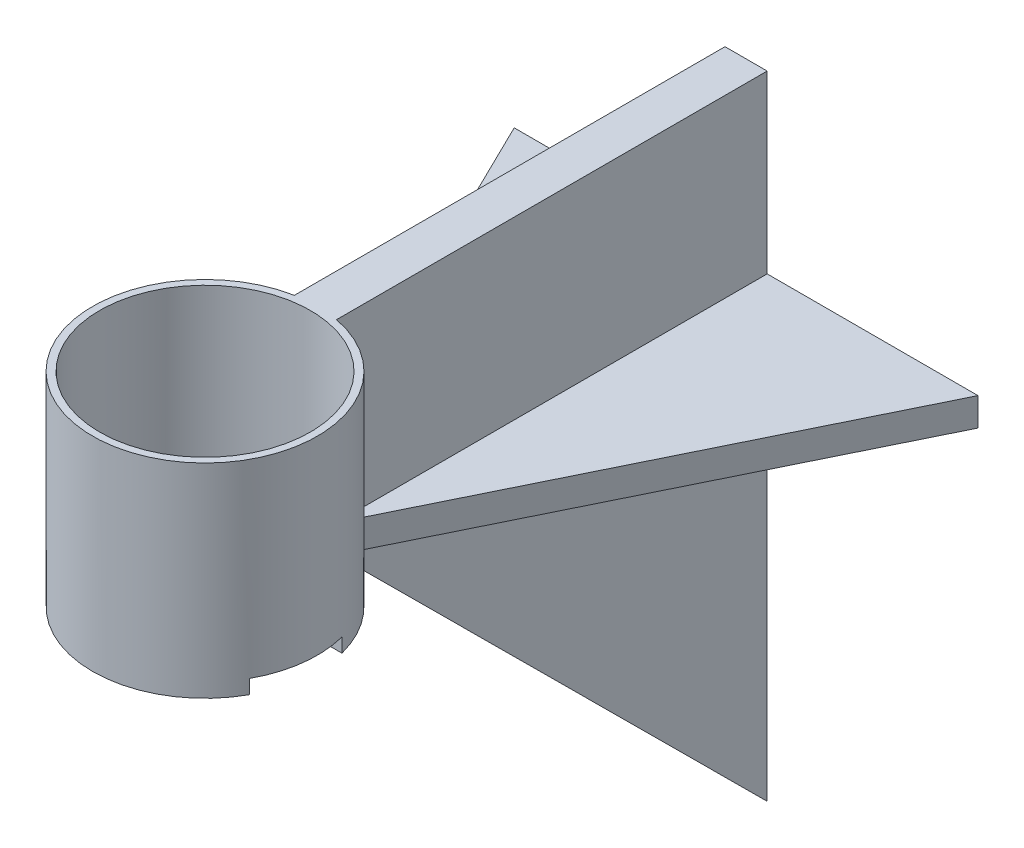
ISO-10303-21;
HEADER;
FILE_DESCRIPTION(('STEP AP214'),'2;1');
FILE_NAME('part.step','',(''),(''),'','','');
FILE_SCHEMA(('AUTOMOTIVE_DESIGN { 1 0 10303 214 1 1 1 1 }'));
ENDSEC;
DATA;
#1=APPLICATION_CONTEXT('core data for automotive mechanical design processes');
#2=APPLICATION_PROTOCOL_DEFINITION('international standard','automotive_design',2000,#1);
#3=PRODUCT_CONTEXT('',#1,'mechanical');
#4=PRODUCT('Part','Part','',(#3));
#5=PRODUCT_RELATED_PRODUCT_CATEGORY('part','',(#4));
#6=PRODUCT_DEFINITION_FORMATION('','',#4);
#7=PRODUCT_DEFINITION_CONTEXT('part definition',#1,'design');
#8=PRODUCT_DEFINITION('design','',#6,#7);
#9=PRODUCT_DEFINITION_SHAPE('','',#8);
#10=(LENGTH_UNIT() NAMED_UNIT(*) SI_UNIT(.MILLI.,.METRE.));
#11=(NAMED_UNIT(*) PLANE_ANGLE_UNIT() SI_UNIT($,.RADIAN.));
#12=(NAMED_UNIT(*) SI_UNIT($,.STERADIAN.) SOLID_ANGLE_UNIT());
#13=UNCERTAINTY_MEASURE_WITH_UNIT(LENGTH_MEASURE(1.E-05),#10,'distance_accuracy_value','');
#14=(GEOMETRIC_REPRESENTATION_CONTEXT(3) GLOBAL_UNCERTAINTY_ASSIGNED_CONTEXT((#13)) GLOBAL_UNIT_ASSIGNED_CONTEXT((#10,
#11,#12)) REPRESENTATION_CONTEXT('',''));
#15=CARTESIAN_POINT('',(0.,0.,0.));
#16=DIRECTION('',(0.,0.,1.));
#17=DIRECTION('',(1.,0.,0.));
#18=AXIS2_PLACEMENT_3D('',#15,#16,#17);
#19=CARTESIAN_POINT('',(-3.81,-36.83,-19.05));
#20=DIRECTION('',(-1.,0.,0.));
#21=DIRECTION('',(0.,0.,1.));
#22=AXIS2_PLACEMENT_3D('',#19,#20,#21);
#23=PLANE('',#22);
#24=DIRECTION('',(0.,1.,0.));
#25=VECTOR('',#24,1.);
#26=CARTESIAN_POINT('',(-3.81,-36.83,-97.79));
#27=LINE('',#26,#25);
#28=CARTESIAN_POINT('',(-3.81,-31.75,-97.79));
#29=VERTEX_POINT('',#28);
#30=CARTESIAN_POINT('',(-3.81,0.,-97.79));
#31=VERTEX_POINT('',#30);
#32=EDGE_CURVE('E277',#29,#31,#27,.T.);
#33=ORIENTED_EDGE('',*,*,#32,.F.);
#34=DIRECTION('',(0.,0.,1.));
#35=VECTOR('',#34,1.);
#36=CARTESIAN_POINT('',(-3.81,-31.75,-19.05));
#37=LINE('',#36,#35);
#38=CARTESIAN_POINT('',(-3.81,-31.75,-19.9596167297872));
#39=VERTEX_POINT('',#38);
#40=EDGE_CURVE('E56',#29,#39,#37,.T.);
#41=ORIENTED_EDGE('',*,*,#40,.T.);
#42=DIRECTION('',(0.,1.,0.));
#43=VECTOR('',#42,1.);
#44=CARTESIAN_POINT('',(-3.81,-35.56,-19.9596167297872));
#45=LINE('',#44,#43);
#46=CARTESIAN_POINT('',(-3.81,0.,-19.9596167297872));
#47=VERTEX_POINT('',#46);
#48=EDGE_CURVE('E282',#39,#47,#45,.T.);
#49=ORIENTED_EDGE('',*,*,#48,.T.);
#50=DIRECTION('',(0.,0.,1.));
#51=VECTOR('',#50,1.);
#52=CARTESIAN_POINT('',(-3.81,0.,-19.05));
#53=LINE('',#52,#51);
#54=EDGE_CURVE('E269',#31,#47,#53,.T.);
#55=ORIENTED_EDGE('',*,*,#54,.F.);
#56=EDGE_LOOP('',(#33,#41,#49,#55));
#57=FACE_BOUND('',#56,.T.);
#58=ADVANCED_FACE('F33',(#57),#23,.T.);
#59=CARTESIAN_POINT('',(3.81,-36.83,-19.05));
#60=DIRECTION('',(1.,0.,0.));
#61=DIRECTION('',(0.,0.,-1.));
#62=AXIS2_PLACEMENT_3D('',#59,#60,#61);
#63=PLANE('',#62);
#64=DIRECTION('',(0.,1.,0.));
#65=VECTOR('',#64,1.);
#66=CARTESIAN_POINT('',(3.81,-35.56,-19.9596167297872));
#67=LINE('',#66,#65);
#68=CARTESIAN_POINT('',(3.81,0.,-19.9596167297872));
#69=VERTEX_POINT('',#68);
#70=CARTESIAN_POINT('',(3.81,-31.75,-19.9596167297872));
#71=VERTEX_POINT('',#70);
#72=EDGE_CURVE('E276',#69,#71,#67,.F.);
#73=ORIENTED_EDGE('',*,*,#72,.T.);
#74=DIRECTION('',(0.,0.,-1.));
#75=VECTOR('',#74,1.);
#76=CARTESIAN_POINT('',(3.81,-31.75,-19.05));
#77=LINE('',#76,#75);
#78=CARTESIAN_POINT('',(3.81,-31.75,-97.79));
#79=VERTEX_POINT('',#78);
#80=EDGE_CURVE('E364',#71,#79,#77,.T.);
#81=ORIENTED_EDGE('',*,*,#80,.T.);
#82=DIRECTION('',(0.,1.,0.));
#83=VECTOR('',#82,1.);
#84=CARTESIAN_POINT('',(3.81,-36.83,-97.79));
#85=LINE('',#84,#83);
#86=CARTESIAN_POINT('',(3.81,0.,-97.79));
#87=VERTEX_POINT('',#86);
#88=EDGE_CURVE('E272',#79,#87,#85,.T.);
#89=ORIENTED_EDGE('',*,*,#88,.T.);
#90=DIRECTION('',(0.,0.,-1.));
#91=VECTOR('',#90,1.);
#92=CARTESIAN_POINT('',(3.81,0.,-19.05));
#93=LINE('',#92,#91);
#94=EDGE_CURVE('E261',#69,#87,#93,.T.);
#95=ORIENTED_EDGE('',*,*,#94,.F.);
#96=EDGE_LOOP('',(#73,#81,#89,#95));
#97=FACE_BOUND('',#96,.T.);
#98=ADVANCED_FACE('F408',(#97),#63,.T.);
#99=CARTESIAN_POINT('',(0.,-35.56,0.));
#100=DIRECTION('',(0.,-1.,0.));
#101=DIRECTION('',(0.,0.,-1.));
#102=AXIS2_PLACEMENT_3D('',#99,#100,#101);
#103=PLANE('',#102);
#104=CARTESIAN_POINT('',(0.,-35.56,0.));
#105=DIRECTION('',(0.,1.,0.));
#106=DIRECTION('',(0.,0.,1.));
#107=AXIS2_PLACEMENT_3D('',#104,#105,#106);
#108=CIRCLE('',#107,19.05);
#109=CARTESIAN_POINT('',(18.3601770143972,-35.56,-5.08));
#110=VERTEX_POINT('',#109);
#111=CARTESIAN_POINT('',(-18.3601770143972,-35.56,-5.08));
#112=VERTEX_POINT('',#111);
#113=EDGE_CURVE('E348',#110,#112,#108,.T.);
#114=ORIENTED_EDGE('',*,*,#113,.T.);
#115=DIRECTION('',(1.,0.,0.));
#116=VECTOR('',#115,1.);
#117=CARTESIAN_POINT('',(0.,-35.56,-5.08));
#118=LINE('',#117,#116);
#119=EDGE_CURVE('E316',#112,#110,#118,.T.);
#120=ORIENTED_EDGE('',*,*,#119,.T.);
#121=EDGE_LOOP('',(#114,#120));
#122=FACE_BOUND('',#121,.T.);
#123=ADVANCED_FACE('F414',(#122),#103,.F.);
#124=CARTESIAN_POINT('',(0.,-36.83,0.));
#125=DIRECTION('',(0.,-1.,0.));
#126=DIRECTION('',(0.,0.,-1.));
#127=AXIS2_PLACEMENT_3D('',#124,#125,#126);
#128=PLANE('',#127);
#129=DIRECTION('',(1.,0.,0.));
#130=VECTOR('',#129,1.);
#131=CARTESIAN_POINT('',(-3.81,-36.83,-19.9596167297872));
#132=LINE('',#131,#130);
#133=CARTESIAN_POINT('',(-3.81,-36.83,-19.9596167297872));
#134=VERTEX_POINT('',#133);
#135=CARTESIAN_POINT('',(3.81,-36.83,-19.9596167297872));
#136=VERTEX_POINT('',#135);
#137=EDGE_CURVE('E255',#134,#136,#132,.T.);
#138=ORIENTED_EDGE('',*,*,#137,.T.);
#139=CARTESIAN_POINT('',(0.,-36.83,0.));
#140=DIRECTION('',(0.,-1.,0.));
#141=DIRECTION('',(0.,0.,-1.));
#142=AXIS2_PLACEMENT_3D('',#139,#140,#141);
#143=CIRCLE('',#142,20.32);
#144=CARTESIAN_POINT('',(19.6747553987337,-36.83,-5.08));
#145=VERTEX_POINT('',#144);
#146=EDGE_CURVE('E344',#136,#145,#143,.T.);
#147=ORIENTED_EDGE('',*,*,#146,.T.);
#148=DIRECTION('',(1.,0.,0.));
#149=VECTOR('',#148,1.);
#150=CARTESIAN_POINT('',(0.,-36.83,-5.08));
#151=LINE('',#150,#149);
#152=CARTESIAN_POINT('',(-19.6747553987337,-36.83,-5.08));
#153=VERTEX_POINT('',#152);
#154=EDGE_CURVE('E358',#153,#145,#151,.T.);
#155=ORIENTED_EDGE('',*,*,#154,.F.);
#156=EDGE_CURVE('E341',#153,#134,#143,.T.);
#157=ORIENTED_EDGE('',*,*,#156,.T.);
#158=EDGE_LOOP('',(#138,#147,#155,#157));
#159=FACE_BOUND('',#158,.T.);
#160=ADVANCED_FACE('F432',(#159),#128,.T.);
#161=CARTESIAN_POINT('',(0.,-35.56,0.));
#162=DIRECTION('',(0.,1.,0.));
#163=DIRECTION('',(0.,0.,1.));
#164=AXIS2_PLACEMENT_3D('',#161,#162,#163);
#165=CYLINDRICAL_SURFACE('',#164,20.32);
#166=EDGE_CURVE('E283',#134,#39,#45,.T.);
#167=ORIENTED_EDGE('',*,*,#166,.F.);
#168=ORIENTED_EDGE('',*,*,#156,.F.);
#169=DIRECTION('',(0.,1.,0.));
#170=VECTOR('',#169,1.);
#171=CARTESIAN_POINT('',(-19.6747553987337,-35.56,-5.08));
#172=LINE('',#171,#170);
#173=CARTESIAN_POINT('',(-19.6747553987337,-34.29,-5.08));
#174=VERTEX_POINT('',#173);
#175=EDGE_CURVE('E327',#174,#153,#172,.F.);
#176=ORIENTED_EDGE('',*,*,#175,.F.);
#177=CARTESIAN_POINT('',(0.,-34.29,0.));
#178=DIRECTION('',(0.,-1.,0.));
#179=DIRECTION('',(0.,0.,-1.));
#180=AXIS2_PLACEMENT_3D('',#177,#178,#179);
#181=CIRCLE('',#180,20.32);
#182=CARTESIAN_POINT('',(-17.7998802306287,-34.29,9.80136030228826));
#183=VERTEX_POINT('',#182);
#184=EDGE_CURVE('E340',#174,#183,#181,.F.);
#185=ORIENTED_EDGE('',*,*,#184,.T.);
#186=DIRECTION('',(0.,-1.,0.));
#187=VECTOR('',#186,1.);
#188=CARTESIAN_POINT('',(-17.7998802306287,-35.56,9.80136030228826));
#189=LINE('',#188,#187);
#190=CARTESIAN_POINT('',(-17.7998802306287,-36.83,9.80136030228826));
#191=VERTEX_POINT('',#190);
#192=EDGE_CURVE('E314',#191,#183,#189,.F.);
#193=ORIENTED_EDGE('',*,*,#192,.F.);
#194=CARTESIAN_POINT('',(17.8015810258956,-36.83,9.79827091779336));
#195=VERTEX_POINT('',#194);
#196=EDGE_CURVE('E343',#195,#191,#143,.T.);
#197=ORIENTED_EDGE('',*,*,#196,.F.);
#198=DIRECTION('',(0.,-1.,0.));
#199=VECTOR('',#198,1.);
#200=CARTESIAN_POINT('',(17.8015810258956,-35.56,9.79827091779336));
#201=LINE('',#200,#199);
#202=CARTESIAN_POINT('',(17.8015810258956,-34.29,9.79827091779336));
#203=VERTEX_POINT('',#202);
#204=EDGE_CURVE('E335',#203,#195,#201,.T.);
#205=ORIENTED_EDGE('',*,*,#204,.F.);
#206=CARTESIAN_POINT('',(19.6747553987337,-34.29,-5.08));
#207=VERTEX_POINT('',#206);
#208=EDGE_CURVE('E337',#203,#207,#181,.F.);
#209=ORIENTED_EDGE('',*,*,#208,.T.);
#210=DIRECTION('',(0.,1.,0.));
#211=VECTOR('',#210,1.);
#212=CARTESIAN_POINT('',(19.6747553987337,-35.56,-5.08));
#213=LINE('',#212,#211);
#214=EDGE_CURVE('E325',#145,#207,#213,.T.);
#215=ORIENTED_EDGE('',*,*,#214,.F.);
#216=ORIENTED_EDGE('',*,*,#146,.F.);
#217=DIRECTION('',(0.,-1.,0.));
#218=VECTOR('',#217,1.);
#219=CARTESIAN_POINT('',(3.81,-31.75,-19.9596167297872));
#220=LINE('',#219,#218);
#221=EDGE_CURVE('E236',#71,#136,#220,.T.);
#222=ORIENTED_EDGE('',*,*,#221,.F.);
#223=ORIENTED_EDGE('',*,*,#72,.F.);
#224=CARTESIAN_POINT('',(0.,0.,0.));
#225=DIRECTION('',(0.,1.,0.));
#226=DIRECTION('',(0.,0.,1.));
#227=AXIS2_PLACEMENT_3D('',#224,#225,#226);
#228=CIRCLE('',#227,20.32);
#229=EDGE_CURVE('E352',#47,#69,#228,.T.);
#230=ORIENTED_EDGE('',*,*,#229,.F.);
#231=ORIENTED_EDGE('',*,*,#48,.F.);
#232=EDGE_LOOP('',(#167,#168,#176,#185,#193,#197,#205,#209,#215,#216,#222,#223,#230,#231));
#233=FACE_BOUND('',#232,.T.);
#234=ADVANCED_FACE('F35',(#233),#165,.T.);
#235=CARTESIAN_POINT('',(0.,0.,0.));
#236=DIRECTION('',(0.,1.,0.));
#237=DIRECTION('',(0.,0.,1.));
#238=AXIS2_PLACEMENT_3D('',#235,#236,#237);
#239=PLANE('',#238);
#240=CARTESIAN_POINT('',(0.,0.,0.));
#241=DIRECTION('',(0.,1.,0.));
#242=DIRECTION('',(0.,0.,1.));
#243=AXIS2_PLACEMENT_3D('',#240,#241,#242);
#244=CIRCLE('',#243,19.05);
#245=CARTESIAN_POINT('',(0.,0.,19.05));
#246=VERTEX_POINT('',#245);
#247=EDGE_CURVE('E349',#246,#246,#244,.T.);
#248=ORIENTED_EDGE('',*,*,#247,.F.);
#249=EDGE_LOOP('',(#248));
#250=FACE_BOUND('',#249,.T.);
#251=ORIENTED_EDGE('',*,*,#229,.T.);
#252=ORIENTED_EDGE('',*,*,#94,.T.);
#253=DIRECTION('',(-1.,0.,0.));
#254=VECTOR('',#253,1.);
#255=CARTESIAN_POINT('',(-3.81,0.,-97.79));
#256=LINE('',#255,#254);
#257=EDGE_CURVE('E266',#87,#31,#256,.T.);
#258=ORIENTED_EDGE('',*,*,#257,.T.);
#259=ORIENTED_EDGE('',*,*,#54,.T.);
#260=EDGE_LOOP('',(#251,#252,#258,#259));
#261=FACE_BOUND('',#260,.T.);
#262=ADVANCED_FACE('F449',(#250,#261),#239,.T.);
#263=CARTESIAN_POINT('',(0.,-35.56,0.));
#264=DIRECTION('',(0.,1.,0.));
#265=DIRECTION('',(0.,0.,1.));
#266=AXIS2_PLACEMENT_3D('',#263,#264,#265);
#267=CYLINDRICAL_SURFACE('',#266,19.05);
#268=DIRECTION('',(0.,1.,0.));
#269=VECTOR('',#268,1.);
#270=CARTESIAN_POINT('',(-18.3601770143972,-35.56,-5.08));
#271=LINE('',#270,#269);
#272=CARTESIAN_POINT('',(-18.3601770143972,-34.29,-5.08));
#273=VERTEX_POINT('',#272);
#274=EDGE_CURVE('E322',#273,#112,#271,.F.);
#275=ORIENTED_EDGE('',*,*,#274,.T.);
#276=ORIENTED_EDGE('',*,*,#113,.F.);
#277=DIRECTION('',(0.,1.,0.));
#278=VECTOR('',#277,1.);
#279=CARTESIAN_POINT('',(18.3601770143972,-35.56,-5.08));
#280=LINE('',#279,#278);
#281=CARTESIAN_POINT('',(18.3601770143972,-34.29,-5.08));
#282=VERTEX_POINT('',#281);
#283=EDGE_CURVE('E319',#110,#282,#280,.T.);
#284=ORIENTED_EDGE('',*,*,#283,.T.);
#285=CARTESIAN_POINT('',(0.,-34.29,0.));
#286=DIRECTION('',(0.,-1.,0.));
#287=DIRECTION('',(0.,0.,-1.));
#288=AXIS2_PLACEMENT_3D('',#285,#286,#287);
#289=CIRCLE('',#288,19.05);
#290=CARTESIAN_POINT('',(16.6900955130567,-34.29,9.18385604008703));
#291=VERTEX_POINT('',#290);
#292=EDGE_CURVE('E361',#291,#282,#289,.F.);
#293=ORIENTED_EDGE('',*,*,#292,.F.);
#294=DIRECTION('',(0.,-1.,0.));
#295=VECTOR('',#294,1.);
#296=CARTESIAN_POINT('',(16.6900955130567,-35.56,9.18385604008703));
#297=LINE('',#296,#295);
#298=CARTESIAN_POINT('',(16.6900955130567,-35.56,9.18385604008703));
#299=VERTEX_POINT('',#298);
#300=EDGE_CURVE('E332',#291,#299,#297,.T.);
#301=ORIENTED_EDGE('',*,*,#300,.T.);
#302=CARTESIAN_POINT('',(-16.6873877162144,-35.56,9.18877528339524));
#303=VERTEX_POINT('',#302);
#304=EDGE_CURVE('E345',#303,#299,#108,.T.);
#305=ORIENTED_EDGE('',*,*,#304,.F.);
#306=DIRECTION('',(0.,-1.,0.));
#307=VECTOR('',#306,1.);
#308=CARTESIAN_POINT('',(-16.6873877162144,-35.56,9.18877528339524));
#309=LINE('',#308,#307);
#310=CARTESIAN_POINT('',(-16.6873877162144,-34.29,9.18877528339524));
#311=VERTEX_POINT('',#310);
#312=EDGE_CURVE('E311',#303,#311,#309,.F.);
#313=ORIENTED_EDGE('',*,*,#312,.T.);
#314=EDGE_CURVE('E363',#273,#311,#289,.F.);
#315=ORIENTED_EDGE('',*,*,#314,.F.);
#316=EDGE_LOOP('',(#275,#276,#284,#293,#301,#305,#313,#315));
#317=FACE_BOUND('',#316,.T.);
#318=ORIENTED_EDGE('',*,*,#247,.T.);
#319=EDGE_LOOP('',(#318));
#320=FACE_BOUND('',#319,.T.);
#321=ADVANCED_FACE('F464',(#317,#320),#267,.F.);
#322=ORIENTED_EDGE('',*,*,#304,.T.);
#323=CARTESIAN_POINT('',(19.6842173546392,-35.56,5.08));
#324=DIRECTION('',(0.,-1.,0.));
#325=DIRECTION('',(0.,0.,-1.));
#326=AXIS2_PLACEMENT_3D('',#323,#324,#325);
#327=CIRCLE('',#326,5.08);
#328=CARTESIAN_POINT('',(14.6042173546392,-35.56,5.08));
#329=VERTEX_POINT('',#328);
#330=EDGE_CURVE('E329',#299,#329,#327,.T.);
#331=ORIENTED_EDGE('',*,*,#330,.T.);
#332=DIRECTION('',(-1.,0.,0.));
#333=VECTOR('',#332,1.);
#334=CARTESIAN_POINT('',(0.,-35.56,5.08));
#335=LINE('',#334,#333);
#336=CARTESIAN_POINT('',(-14.5947553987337,-35.56,5.08));
#337=VERTEX_POINT('',#336);
#338=EDGE_CURVE('E303',#329,#337,#335,.T.);
#339=ORIENTED_EDGE('',*,*,#338,.T.);
#340=CARTESIAN_POINT('',(-19.6747553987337,-35.56,5.08));
#341=DIRECTION('',(0.,-1.,0.));
#342=DIRECTION('',(0.,0.,-1.));
#343=AXIS2_PLACEMENT_3D('',#340,#341,#342);
#344=CIRCLE('',#343,5.08);
#345=EDGE_CURVE('E308',#337,#303,#344,.T.);
#346=ORIENTED_EDGE('',*,*,#345,.T.);
#347=EDGE_LOOP('',(#322,#331,#339,#346));
#348=FACE_BOUND('',#347,.T.);
#349=ADVANCED_FACE('F471',(#348),#103,.F.);
#350=CARTESIAN_POINT('',(19.6842173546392,-36.83,5.08));
#351=DIRECTION('',(0.,-1.,0.));
#352=DIRECTION('',(0.,0.,-1.));
#353=AXIS2_PLACEMENT_3D('',#350,#351,#352);
#354=CIRCLE('',#353,5.08);
#355=CARTESIAN_POINT('',(14.6042173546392,-36.83,5.08));
#356=VERTEX_POINT('',#355);
#357=EDGE_CURVE('E355',#195,#356,#354,.T.);
#358=ORIENTED_EDGE('',*,*,#357,.F.);
#359=ORIENTED_EDGE('',*,*,#196,.T.);
#360=CARTESIAN_POINT('',(-19.6747553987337,-36.83,5.08));
#361=DIRECTION('',(0.,-1.,0.));
#362=DIRECTION('',(0.,0.,-1.));
#363=AXIS2_PLACEMENT_3D('',#360,#361,#362);
#364=CIRCLE('',#363,5.08);
#365=CARTESIAN_POINT('',(-14.5947553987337,-36.83,5.08));
#366=VERTEX_POINT('',#365);
#367=EDGE_CURVE('E291',#366,#191,#364,.T.);
#368=ORIENTED_EDGE('',*,*,#367,.F.);
#369=DIRECTION('',(-1.,0.,0.));
#370=VECTOR('',#369,1.);
#371=CARTESIAN_POINT('',(-14.5947553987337,-36.83,5.08));
#372=LINE('',#371,#370);
#373=EDGE_CURVE('E286',#356,#366,#372,.T.);
#374=ORIENTED_EDGE('',*,*,#373,.F.);
#375=EDGE_LOOP('',(#358,#359,#368,#374));
#376=FACE_BOUND('',#375,.T.);
#377=ADVANCED_FACE('F483',(#376),#128,.T.);
#378=CARTESIAN_POINT('',(19.6842173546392,-34.29,5.08));
#379=DIRECTION('',(0.,-1.,0.));
#380=DIRECTION('',(0.,0.,-1.));
#381=AXIS2_PLACEMENT_3D('',#378,#379,#380);
#382=PLANE('',#381);
#383=DIRECTION('',(1.,0.,0.));
#384=VECTOR('',#383,1.);
#385=CARTESIAN_POINT('',(-22.86,-34.29,-5.08));
#386=LINE('',#385,#384);
#387=EDGE_CURVE('E297',#174,#273,#386,.T.);
#388=ORIENTED_EDGE('',*,*,#387,.T.);
#389=ORIENTED_EDGE('',*,*,#314,.T.);
#390=CARTESIAN_POINT('',(-19.6747553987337,-34.29,5.08));
#391=DIRECTION('',(0.,-1.,0.));
#392=DIRECTION('',(0.,0.,-1.));
#393=AXIS2_PLACEMENT_3D('',#390,#391,#392);
#394=CIRCLE('',#393,5.08);
#395=EDGE_CURVE('E290',#311,#183,#394,.T.);
#396=ORIENTED_EDGE('',*,*,#395,.T.);
#397=ORIENTED_EDGE('',*,*,#184,.F.);
#398=EDGE_LOOP('',(#388,#389,#396,#397));
#399=FACE_BOUND('',#398,.T.);
#400=ADVANCED_FACE('F461',(#399),#382,.T.);
#401=CARTESIAN_POINT('',(19.6842173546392,-34.29,5.08));
#402=DIRECTION('',(0.,-1.,0.));
#403=DIRECTION('',(0.,0.,-1.));
#404=AXIS2_PLACEMENT_3D('',#401,#402,#403);
#405=CIRCLE('',#404,5.08);
#406=EDGE_CURVE('E287',#203,#291,#405,.T.);
#407=ORIENTED_EDGE('',*,*,#406,.T.);
#408=ORIENTED_EDGE('',*,*,#292,.T.);
#409=EDGE_CURVE('E294',#282,#207,#386,.T.);
#410=ORIENTED_EDGE('',*,*,#409,.T.);
#411=ORIENTED_EDGE('',*,*,#208,.F.);
#412=EDGE_LOOP('',(#407,#408,#410,#411));
#413=FACE_BOUND('',#412,.T.);
#414=ADVANCED_FACE('F485',(#413),#382,.T.);
#415=CARTESIAN_POINT('',(19.6842173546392,-34.29,5.08));
#416=DIRECTION('',(0.,-1.,0.));
#417=DIRECTION('',(0.,0.,-1.));
#418=AXIS2_PLACEMENT_3D('',#415,#416,#417);
#419=CYLINDRICAL_SURFACE('',#418,5.08);
#420=ORIENTED_EDGE('',*,*,#204,.T.);
#421=ORIENTED_EDGE('',*,*,#357,.T.);
#422=DIRECTION('',(0.,-1.,0.));
#423=VECTOR('',#422,1.);
#424=CARTESIAN_POINT('',(14.6042173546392,-34.29,5.08));
#425=LINE('',#424,#423);
#426=EDGE_CURVE('E304',#329,#356,#425,.T.);
#427=ORIENTED_EDGE('',*,*,#426,.F.);
#428=ORIENTED_EDGE('',*,*,#330,.F.);
#429=ORIENTED_EDGE('',*,*,#300,.F.);
#430=ORIENTED_EDGE('',*,*,#406,.F.);
#431=EDGE_LOOP('',(#420,#421,#427,#428,#429,#430));
#432=FACE_BOUND('',#431,.T.);
#433=ADVANCED_FACE('F474',(#432),#419,.F.);
#434=CARTESIAN_POINT('',(-22.86,-34.29,-5.08));
#435=DIRECTION('',(0.,0.,-1.));
#436=DIRECTION('',(-1.,0.,0.));
#437=AXIS2_PLACEMENT_3D('',#434,#435,#436);
#438=PLANE('',#437);
#439=ORIENTED_EDGE('',*,*,#175,.T.);
#440=ORIENTED_EDGE('',*,*,#154,.T.);
#441=ORIENTED_EDGE('',*,*,#214,.T.);
#442=ORIENTED_EDGE('',*,*,#409,.F.);
#443=ORIENTED_EDGE('',*,*,#283,.F.);
#444=ORIENTED_EDGE('',*,*,#119,.F.);
#445=ORIENTED_EDGE('',*,*,#274,.F.);
#446=ORIENTED_EDGE('',*,*,#387,.F.);
#447=EDGE_LOOP('',(#439,#440,#441,#442,#443,#444,#445,#446));
#448=FACE_BOUND('',#447,.T.);
#449=ADVANCED_FACE('F456',(#448),#438,.F.);
#450=CARTESIAN_POINT('',(-19.6747553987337,-34.29,5.08));
#451=DIRECTION('',(0.,-1.,0.));
#452=DIRECTION('',(0.,0.,-1.));
#453=AXIS2_PLACEMENT_3D('',#450,#451,#452);
#454=CYLINDRICAL_SURFACE('',#453,5.08);
#455=ORIENTED_EDGE('',*,*,#192,.T.);
#456=ORIENTED_EDGE('',*,*,#395,.F.);
#457=ORIENTED_EDGE('',*,*,#312,.F.);
#458=ORIENTED_EDGE('',*,*,#345,.F.);
#459=DIRECTION('',(0.,-1.,0.));
#460=VECTOR('',#459,1.);
#461=CARTESIAN_POINT('',(-14.5947553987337,-34.29,5.08));
#462=LINE('',#461,#460);
#463=EDGE_CURVE('E301',#337,#366,#462,.T.);
#464=ORIENTED_EDGE('',*,*,#463,.T.);
#465=ORIENTED_EDGE('',*,*,#367,.T.);
#466=EDGE_LOOP('',(#455,#456,#457,#458,#464,#465));
#467=FACE_BOUND('',#466,.T.);
#468=ADVANCED_FACE('F426',(#467),#454,.F.);
#469=CARTESIAN_POINT('',(-14.5947553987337,-34.29,5.08));
#470=DIRECTION('',(0.,0.,1.));
#471=DIRECTION('',(1.,0.,0.));
#472=AXIS2_PLACEMENT_3D('',#469,#470,#471);
#473=PLANE('',#472);
#474=ORIENTED_EDGE('',*,*,#426,.T.);
#475=ORIENTED_EDGE('',*,*,#373,.T.);
#476=ORIENTED_EDGE('',*,*,#463,.F.);
#477=ORIENTED_EDGE('',*,*,#338,.F.);
#478=EDGE_LOOP('',(#474,#475,#476,#477));
#479=FACE_BOUND('',#478,.T.);
#480=ADVANCED_FACE('F421',(#479),#473,.F.);
#481=DIRECTION('',(0.,0.,1.));
#482=VECTOR('',#481,1.);
#483=CARTESIAN_POINT('',(-3.81,-36.83,-19.05));
#484=LINE('',#483,#482);
#485=CARTESIAN_POINT('',(-3.81,-36.83,-97.79));
#486=VERTEX_POINT('',#485);
#487=EDGE_CURVE('E247',#486,#134,#484,.T.);
#488=ORIENTED_EDGE('',*,*,#487,.F.);
#489=CARTESIAN_POINT('',(-3.81,-114.3,-97.79));
#490=VERTEX_POINT('',#489);
#491=EDGE_CURVE('E273',#490,#486,#27,.T.);
#492=ORIENTED_EDGE('',*,*,#491,.F.);
#493=DIRECTION('',(0.,-0.705464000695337,-0.708745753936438));
#494=VECTOR('',#493,1.);
#495=CARTESIAN_POINT('',(-3.81,-114.3,-97.79));
#496=LINE('',#495,#494);
#497=EDGE_CURVE('E252',#134,#490,#496,.T.);
#498=ORIENTED_EDGE('',*,*,#497,.F.);
#499=EDGE_LOOP('',(#488,#492,#498));
#500=FACE_BOUND('',#499,.T.);
#501=ADVANCED_FACE('F410',(#500),#23,.T.);
#502=CARTESIAN_POINT('',(-3.81,-36.83,-97.79));
#503=DIRECTION('',(0.,0.,-1.));
#504=DIRECTION('',(-1.,0.,0.));
#505=AXIS2_PLACEMENT_3D('',#502,#503,#504);
#506=PLANE('',#505);
#507=DIRECTION('',(0.,-1.,0.));
#508=VECTOR('',#507,1.);
#509=CARTESIAN_POINT('',(-2.286,-38.1,-97.79));
#510=LINE('',#509,#508);
#511=CARTESIAN_POINT('',(-2.286,-38.1,-97.79));
#512=VERTEX_POINT('',#511);
#513=CARTESIAN_POINT('',(-2.286,-114.3,-97.79));
#514=VERTEX_POINT('',#513);
#515=EDGE_CURVE('E230',#512,#514,#510,.T.);
#516=ORIENTED_EDGE('',*,*,#515,.T.);
#517=DIRECTION('',(1.,0.,0.));
#518=VECTOR('',#517,1.);
#519=CARTESIAN_POINT('',(-3.81,-114.3,-97.79));
#520=LINE('',#519,#518);
#521=EDGE_CURVE('E258',#490,#514,#520,.T.);
#522=ORIENTED_EDGE('',*,*,#521,.F.);
#523=ORIENTED_EDGE('',*,*,#491,.T.);
#524=DIRECTION('',(1.,0.,0.));
#525=VECTOR('',#524,1.);
#526=CARTESIAN_POINT('',(3.81,-36.83,-97.79));
#527=LINE('',#526,#525);
#528=CARTESIAN_POINT('',(-41.91,-36.83,-97.79));
#529=VERTEX_POINT('',#528);
#530=EDGE_CURVE('E231',#529,#486,#527,.T.);
#531=ORIENTED_EDGE('',*,*,#530,.F.);
#532=DIRECTION('',(0.,-1.,0.));
#533=VECTOR('',#532,1.);
#534=CARTESIAN_POINT('',(-41.91,-31.75,-97.79));
#535=LINE('',#534,#533);
#536=CARTESIAN_POINT('',(-41.91,-31.75,-97.79));
#537=VERTEX_POINT('',#536);
#538=EDGE_CURVE('E225',#537,#529,#535,.T.);
#539=ORIENTED_EDGE('',*,*,#538,.F.);
#540=DIRECTION('',(1.,0.,0.));
#541=VECTOR('',#540,1.);
#542=CARTESIAN_POINT('',(-41.91,-31.75,-97.79));
#543=LINE('',#542,#541);
#544=EDGE_CURVE('E219',#537,#29,#543,.T.);
#545=ORIENTED_EDGE('',*,*,#544,.T.);
#546=ORIENTED_EDGE('',*,*,#32,.T.);
#547=ORIENTED_EDGE('',*,*,#257,.F.);
#548=ORIENTED_EDGE('',*,*,#88,.F.);
#549=CARTESIAN_POINT('',(41.91,-31.75,-97.79));
#550=VERTEX_POINT('',#549);
#551=EDGE_CURVE('E217',#79,#550,#543,.T.);
#552=ORIENTED_EDGE('',*,*,#551,.T.);
#553=DIRECTION('',(0.,-1.,0.));
#554=VECTOR('',#553,1.);
#555=CARTESIAN_POINT('',(41.91,-31.75,-97.79));
#556=LINE('',#555,#554);
#557=CARTESIAN_POINT('',(41.91,-36.83,-97.79));
#558=VERTEX_POINT('',#557);
#559=EDGE_CURVE('E240',#550,#558,#556,.T.);
#560=ORIENTED_EDGE('',*,*,#559,.T.);
#561=CARTESIAN_POINT('',(3.81,-36.83,-97.79));
#562=VERTEX_POINT('',#561);
#563=EDGE_CURVE('E229',#562,#558,#527,.T.);
#564=ORIENTED_EDGE('',*,*,#563,.F.);
#565=CARTESIAN_POINT('',(3.81,-114.3,-97.79));
#566=VERTEX_POINT('',#565);
#567=EDGE_CURVE('E278',#566,#562,#85,.T.);
#568=ORIENTED_EDGE('',*,*,#567,.F.);
#569=CARTESIAN_POINT('',(2.286,-114.3,-97.79));
#570=VERTEX_POINT('',#569);
#571=EDGE_CURVE('E207',#570,#566,#520,.T.);
#572=ORIENTED_EDGE('',*,*,#571,.F.);
#573=DIRECTION('',(0.,-1.,0.));
#574=VECTOR('',#573,1.);
#575=CARTESIAN_POINT('',(2.286,-38.1,-97.79));
#576=LINE('',#575,#574);
#577=CARTESIAN_POINT('',(2.286,-38.1,-97.79));
#578=VERTEX_POINT('',#577);
#579=EDGE_CURVE('E48',#578,#570,#576,.T.);
#580=ORIENTED_EDGE('',*,*,#579,.F.);
#581=DIRECTION('',(1.,0.,0.));
#582=VECTOR('',#581,1.);
#583=CARTESIAN_POINT('',(2.286,-38.1,-97.79));
#584=LINE('',#583,#582);
#585=EDGE_CURVE('E194',#512,#578,#584,.T.);
#586=ORIENTED_EDGE('',*,*,#585,.F.);
#587=EDGE_LOOP('',(#516,#522,#523,#531,#539,#545,#546,#547,#548,#552,#560,#564,#568,#572,#580,#586));
#588=FACE_BOUND('',#587,.T.);
#589=ADVANCED_FACE('F205',(#588),#506,.T.);
#590=DIRECTION('',(0.,0.,-1.));
#591=VECTOR('',#590,1.);
#592=CARTESIAN_POINT('',(3.81,-36.83,-19.05));
#593=LINE('',#592,#591);
#594=EDGE_CURVE('E239',#136,#562,#593,.T.);
#595=ORIENTED_EDGE('',*,*,#594,.F.);
#596=DIRECTION('',(0.,-0.705464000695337,-0.708745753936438));
#597=VECTOR('',#596,1.);
#598=CARTESIAN_POINT('',(3.81,-114.3,-97.79));
#599=LINE('',#598,#597);
#600=EDGE_CURVE('E251',#136,#566,#599,.T.);
#601=ORIENTED_EDGE('',*,*,#600,.T.);
#602=ORIENTED_EDGE('',*,*,#567,.T.);
#603=EDGE_LOOP('',(#595,#601,#602));
#604=FACE_BOUND('',#603,.T.);
#605=ADVANCED_FACE('F417',(#604),#63,.T.);
#606=CARTESIAN_POINT('',(-3.81,-114.3,-97.79));
#607=DIRECTION('',(0.,-0.708745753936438,0.705464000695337));
#608=DIRECTION('',(0.,-0.705464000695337,-0.708745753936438));
#609=AXIS2_PLACEMENT_3D('',#606,#607,#608);
#610=PLANE('',#609);
#611=DIRECTION('',(0.,-0.705464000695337,-0.708745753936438));
#612=VECTOR('',#611,1.);
#613=CARTESIAN_POINT('',(-2.286,-114.3,-97.79));
#614=LINE('',#613,#612);
#615=CARTESIAN_POINT('',(-2.286,-109.749170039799,-93.218));
#616=VERTEX_POINT('',#615);
#617=EDGE_CURVE('E11',#616,#514,#614,.T.);
#618=ORIENTED_EDGE('',*,*,#617,.F.);
#619=DIRECTION('',(-1.,0.,0.));
#620=VECTOR('',#619,1.);
#621=CARTESIAN_POINT('',(-3.81,-109.749170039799,-93.218));
#622=LINE('',#621,#620);
#623=CARTESIAN_POINT('',(2.286,-109.749170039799,-93.218));
#624=VERTEX_POINT('',#623);
#625=EDGE_CURVE('E41',#624,#616,#622,.T.);
#626=ORIENTED_EDGE('',*,*,#625,.F.);
#627=DIRECTION('',(0.,0.705464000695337,0.708745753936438));
#628=VECTOR('',#627,1.);
#629=CARTESIAN_POINT('',(2.286,-114.3,-97.79));
#630=LINE('',#629,#628);
#631=EDGE_CURVE('E366',#570,#624,#630,.T.);
#632=ORIENTED_EDGE('',*,*,#631,.F.);
#633=ORIENTED_EDGE('',*,*,#571,.T.);
#634=ORIENTED_EDGE('',*,*,#600,.F.);
#635=ORIENTED_EDGE('',*,*,#137,.F.);
#636=ORIENTED_EDGE('',*,*,#497,.T.);
#637=ORIENTED_EDGE('',*,*,#521,.T.);
#638=EDGE_LOOP('',(#618,#626,#632,#633,#634,#635,#636,#637));
#639=FACE_BOUND('',#638,.T.);
#640=ADVANCED_FACE('F375',(#639),#610,.T.);
#641=CARTESIAN_POINT('',(0.,-31.75,0.));
#642=DIRECTION('',(0.,-1.,0.));
#643=DIRECTION('',(0.,0.,-1.));
#644=AXIS2_PLACEMENT_3D('',#641,#642,#643);
#645=PLANE('',#644);
#646=ORIENTED_EDGE('',*,*,#80,.F.);
#647=DIRECTION('',(-0.439671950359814,0.,0.898158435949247));
#648=VECTOR('',#647,1.);
#649=CARTESIAN_POINT('',(41.91,-31.75,-97.79));
#650=LINE('',#649,#648);
#651=EDGE_CURVE('E222',#550,#71,#650,.T.);
#652=ORIENTED_EDGE('',*,*,#651,.F.);
#653=ORIENTED_EDGE('',*,*,#551,.F.);
#654=EDGE_LOOP('',(#646,#652,#653));
#655=FACE_BOUND('',#654,.T.);
#656=ADVANCED_FACE('F395',(#655),#645,.F.);
#657=CARTESIAN_POINT('',(0.,-36.83,0.));
#658=DIRECTION('',(0.,-1.,0.));
#659=DIRECTION('',(0.,0.,-1.));
#660=AXIS2_PLACEMENT_3D('',#657,#658,#659);
#661=PLANE('',#660);
#662=DIRECTION('',(-0.439671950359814,0.,0.898158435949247));
#663=VECTOR('',#662,1.);
#664=CARTESIAN_POINT('',(41.91,-36.83,-97.79));
#665=LINE('',#664,#663);
#666=EDGE_CURVE('E218',#558,#136,#665,.T.);
#667=ORIENTED_EDGE('',*,*,#666,.T.);
#668=ORIENTED_EDGE('',*,*,#594,.T.);
#669=ORIENTED_EDGE('',*,*,#563,.T.);
#670=EDGE_LOOP('',(#667,#668,#669));
#671=FACE_BOUND('',#670,.T.);
#672=ADVANCED_FACE('F401',(#671),#661,.T.);
#673=CARTESIAN_POINT('',(41.91,-31.75,-97.79));
#674=DIRECTION('',(0.898158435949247,0.,0.439671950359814));
#675=DIRECTION('',(0.439671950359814,0.,-0.898158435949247));
#676=AXIS2_PLACEMENT_3D('',#673,#674,#675);
#677=PLANE('',#676);
#678=ORIENTED_EDGE('',*,*,#666,.F.);
#679=ORIENTED_EDGE('',*,*,#559,.F.);
#680=ORIENTED_EDGE('',*,*,#651,.T.);
#681=ORIENTED_EDGE('',*,*,#221,.T.);
#682=EDGE_LOOP('',(#678,#679,#680,#681));
#683=FACE_BOUND('',#682,.T.);
#684=ADVANCED_FACE('F393',(#683),#677,.T.);
#685=ORIENTED_EDGE('',*,*,#40,.F.);
#686=ORIENTED_EDGE('',*,*,#544,.F.);
#687=DIRECTION('',(-0.439671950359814,0.,-0.898158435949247));
#688=VECTOR('',#687,1.);
#689=CARTESIAN_POINT('',(-3.81,-31.75,-19.9596167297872));
#690=LINE('',#689,#688);
#691=EDGE_CURVE('E214',#39,#537,#690,.T.);
#692=ORIENTED_EDGE('',*,*,#691,.F.);
#693=EDGE_LOOP('',(#685,#686,#692));
#694=FACE_BOUND('',#693,.T.);
#695=ADVANCED_FACE('F391',(#694),#645,.F.);
#696=ORIENTED_EDGE('',*,*,#530,.T.);
#697=ORIENTED_EDGE('',*,*,#487,.T.);
#698=DIRECTION('',(-0.439671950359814,0.,-0.898158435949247));
#699=VECTOR('',#698,1.);
#700=CARTESIAN_POINT('',(-3.81,-36.83,-19.9596167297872));
#701=LINE('',#700,#699);
#702=EDGE_CURVE('E226',#134,#529,#701,.T.);
#703=ORIENTED_EDGE('',*,*,#702,.T.);
#704=EDGE_LOOP('',(#696,#697,#703));
#705=FACE_BOUND('',#704,.T.);
#706=ADVANCED_FACE('F383',(#705),#661,.T.);
#707=CARTESIAN_POINT('',(-3.81,-31.75,-19.9596167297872));
#708=DIRECTION('',(-0.898158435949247,0.,0.439671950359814));
#709=DIRECTION('',(0.439671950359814,0.,0.898158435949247));
#710=AXIS2_PLACEMENT_3D('',#707,#708,#709);
#711=PLANE('',#710);
#712=ORIENTED_EDGE('',*,*,#702,.F.);
#713=ORIENTED_EDGE('',*,*,#166,.T.);
#714=ORIENTED_EDGE('',*,*,#691,.T.);
#715=ORIENTED_EDGE('',*,*,#538,.T.);
#716=EDGE_LOOP('',(#712,#713,#714,#715));
#717=FACE_BOUND('',#716,.T.);
#718=ADVANCED_FACE('F386',(#717),#711,.T.);
#719=CARTESIAN_POINT('',(-2.286,-38.1,-97.79));
#720=DIRECTION('',(-1.,0.,0.));
#721=DIRECTION('',(0.,0.,1.));
#722=AXIS2_PLACEMENT_3D('',#719,#720,#721);
#723=PLANE('',#722);
#724=ORIENTED_EDGE('',*,*,#617,.T.);
#725=ORIENTED_EDGE('',*,*,#515,.F.);
#726=DIRECTION('',(0.,0.,-1.));
#727=VECTOR('',#726,1.);
#728=CARTESIAN_POINT('',(-2.286,-38.1,-97.79));
#729=LINE('',#728,#727);
#730=CARTESIAN_POINT('',(-2.286,-38.1,-93.218));
#731=VERTEX_POINT('',#730);
#732=EDGE_CURVE('E200',#731,#512,#729,.T.);
#733=ORIENTED_EDGE('',*,*,#732,.F.);
#734=DIRECTION('',(0.,-1.,0.));
#735=VECTOR('',#734,1.);
#736=CARTESIAN_POINT('',(-2.286,-38.1,-93.218));
#737=LINE('',#736,#735);
#738=EDGE_CURVE('E209',#731,#616,#737,.T.);
#739=ORIENTED_EDGE('',*,*,#738,.T.);
#740=EDGE_LOOP('',(#724,#725,#733,#739));
#741=FACE_BOUND('',#740,.T.);
#742=ADVANCED_FACE('F374',(#741),#723,.F.);
#743=CARTESIAN_POINT('',(-2.286,-38.1,-93.218));
#744=DIRECTION('',(0.,0.,1.));
#745=DIRECTION('',(1.,0.,0.));
#746=AXIS2_PLACEMENT_3D('',#743,#744,#745);
#747=PLANE('',#746);
#748=ORIENTED_EDGE('',*,*,#625,.T.);
#749=ORIENTED_EDGE('',*,*,#738,.F.);
#750=DIRECTION('',(-1.,0.,0.));
#751=VECTOR('',#750,1.);
#752=CARTESIAN_POINT('',(-2.286,-38.1,-93.218));
#753=LINE('',#752,#751);
#754=CARTESIAN_POINT('',(2.286,-38.1,-93.218));
#755=VERTEX_POINT('',#754);
#756=EDGE_CURVE('E193',#755,#731,#753,.T.);
#757=ORIENTED_EDGE('',*,*,#756,.F.);
#758=DIRECTION('',(0.,-1.,0.));
#759=VECTOR('',#758,1.);
#760=CARTESIAN_POINT('',(2.286,-38.1,-93.218));
#761=LINE('',#760,#759);
#762=EDGE_CURVE('E189',#755,#624,#761,.T.);
#763=ORIENTED_EDGE('',*,*,#762,.T.);
#764=EDGE_LOOP('',(#748,#749,#757,#763));
#765=FACE_BOUND('',#764,.T.);
#766=ADVANCED_FACE('F370',(#765),#747,.F.);
#767=CARTESIAN_POINT('',(2.286,-38.1,-93.218));
#768=DIRECTION('',(1.,0.,0.));
#769=DIRECTION('',(0.,0.,-1.));
#770=AXIS2_PLACEMENT_3D('',#767,#768,#769);
#771=PLANE('',#770);
#772=ORIENTED_EDGE('',*,*,#631,.T.);
#773=ORIENTED_EDGE('',*,*,#762,.F.);
#774=DIRECTION('',(0.,0.,1.));
#775=VECTOR('',#774,1.);
#776=CARTESIAN_POINT('',(2.286,-38.1,-93.218));
#777=LINE('',#776,#775);
#778=EDGE_CURVE('E185',#578,#755,#777,.T.);
#779=ORIENTED_EDGE('',*,*,#778,.F.);
#780=ORIENTED_EDGE('',*,*,#579,.T.);
#781=EDGE_LOOP('',(#772,#773,#779,#780));
#782=FACE_BOUND('',#781,.T.);
#783=ADVANCED_FACE('F187',(#782),#771,.F.);
#784=CARTESIAN_POINT('',(0.,-38.1,0.));
#785=DIRECTION('',(0.,1.,0.));
#786=DIRECTION('',(0.,0.,1.));
#787=AXIS2_PLACEMENT_3D('',#784,#785,#786);
#788=PLANE('',#787);
#789=ORIENTED_EDGE('',*,*,#585,.T.);
#790=ORIENTED_EDGE('',*,*,#778,.T.);
#791=ORIENTED_EDGE('',*,*,#756,.T.);
#792=ORIENTED_EDGE('',*,*,#732,.T.);
#793=EDGE_LOOP('',(#789,#790,#791,#792));
#794=FACE_BOUND('',#793,.T.);
#795=ADVANCED_FACE('F198',(#794),#788,.F.);
#796=CLOSED_SHELL('',(#58,#98,#123,#160,#234,#262,#321,#349,#377,#400,#414,#433,#449,#468,#480,
#501,#589,#605,#640,#656,#672,#684,#695,#706,#718,#742,#766,#783,#795));
#797=MANIFOLD_SOLID_BREP('B2',#796);
#798=ADVANCED_BREP_SHAPE_REPRESENTATION('',(#18,#797),#14);
#799=SHAPE_DEFINITION_REPRESENTATION(#9,#798);
ENDSEC;
END-ISO-10303-21;
